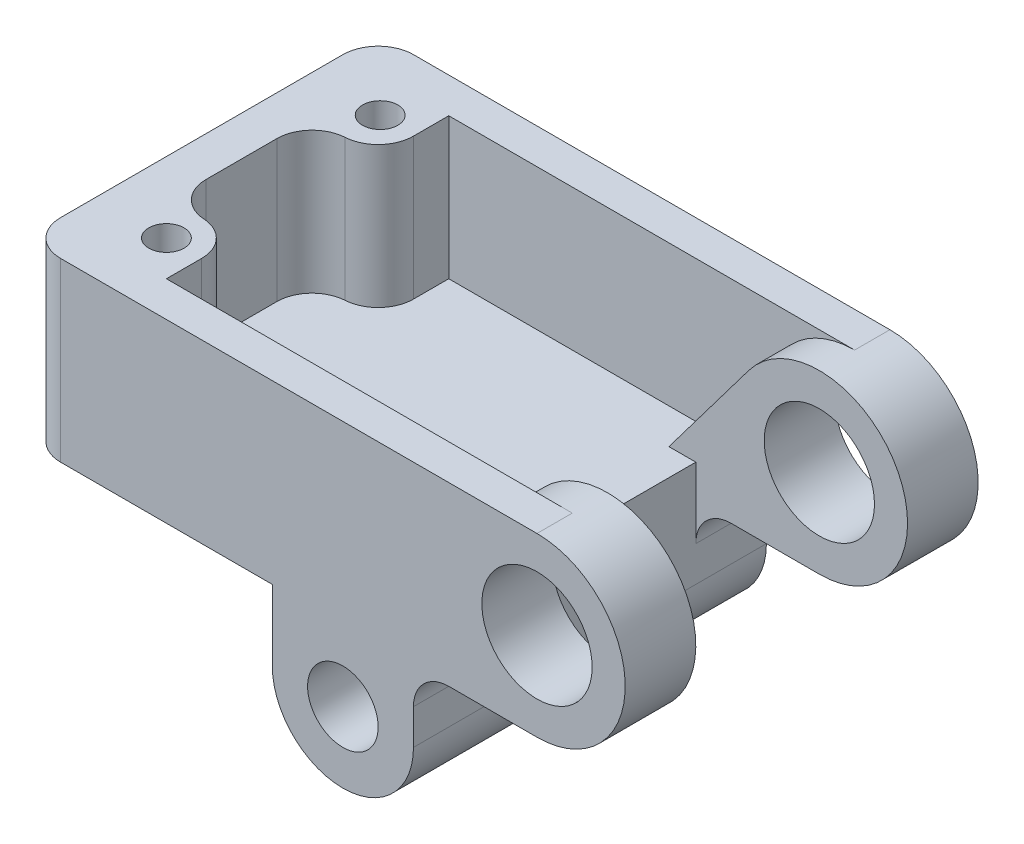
from build123d import *

# Parameters (mm, degrees)
SKETCH1_R                = 8
SKETCH1_R_2              = 12.5
BOSS_EXTRUDE1_DEPTH      = 40
CUT_EXTRUDE1_DEPTH       = 32
CUT_EXTRUDE2_REACH       = 149.296
SKETCH5_W                = 70.132841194
SKETCH5_H                = 64
BOSS_EXTRUDE2_START      = 8
SKETCH6_R                = 12.5
BOSS_EXTRUDE2_DEPTH      = 8
FILLET1_R                = 8
F_8_0_8_DIAMETER_HOLE1_D = 8
SKETCH11_R               = 4
BOSS_EXTRUDE3_DEPTH      = 8


with BuildPart() as part:
    # Sketch1 → Boss-Extrude1 (new, symmetric)
    with BuildSketch(Plane.XY):
        with BuildLine():
            Line((0, 40), (0, 0))
            Line((0, 0), (56, 0))
            Line((56, 0), (56, -16))
            ThreePointArc((56, -16), (72, -32), (88, -16))
            Line((88, -16), (88, 0))
            Line((88, 0), (116, 0))
            ThreePointArc((116, 0), (136, 20), (116, 40))
            Line((116, 40), (0, 40))
        make_face()
        with Locations((72, -16)):
            Circle(SKETCH1_R, mode=Mode.SUBTRACT)
        with Locations((116, 20)):
            Circle(SKETCH1_R_2, mode=Mode.SUBTRACT)
    extrude(amount=BOSS_EXTRUDE1_DEPTH, both=True)

    # Sketch2 → Cut-Extrude1 (cut)
    with BuildSketch(Plane(origin=(0, 40, 0), x_dir=(1, 0, 0), z_dir=(0, 1, 0))):
        with BuildLine():
            Line((9, 8.031280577), (9, -8.031280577))
            ThreePointArc((9, -8.031280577), (11.169048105, -13.508506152), (16.5, -16.015640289))
            ThreePointArc((16.5, -16.015640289), (21.830951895, -18.522774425), (24, -24))
            Line((24, -24), (24, -32))
            Line((24, -32), (150.373043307, -32))
            Line((150.373043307, -32), (150.373043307, 32))
            Line((150.373043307, 32), (24, 32))
            Line((24, 32), (24, 24))
            ThreePointArc((24, 24), (21.830951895, 18.522774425), (16.5, 16.015640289))
            ThreePointArc((16.5, 16.015640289), (11.169048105, 13.508506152), (9, 8.031280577))
        make_face()
    extrude(amount=-CUT_EXTRUDE1_DEPTH, mode=Mode.SUBTRACT)

    # Sketch5 → Cut-Extrude2 (cut, up to next)
    with BuildSketch(Plane(origin=(0, 8, 0), x_dir=(1, 0, 0), z_dir=(0, 1, 0)), mode=Mode.PRIVATE) as cut_extrude2_sk1:
        with Locations((123.066420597, 0)):
            Rectangle(SKETCH5_W, SKETCH5_H)
    cut_extrude2_tool1 = extrude(cut_extrude2_sk1.sketch, amount=-CUT_EXTRUDE2_REACH, mode=Mode.PRIVATE) & part.part
    add(cut_extrude2_tool1.solids().sort_by_distance((123.066421, 8, 0))[0], mode=Mode.SUBTRACT)

    # Sketch6 → Boss-Extrude2 (add)
    with BuildSketch(Plane.XY.offset(-32).offset(BOSS_EXTRUDE2_START)):
        with BuildLine():
            Line((88, 0), (116, 0))
            ThreePointArc((116, 0), (136, 20), (116, 40))
            ThreePointArc((116, 40), (107.076043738, 37.898687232), (100.027289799, 32.036300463))
            Line((100.027289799, 32.036300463), (81.914638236, 8))
            Line((81.914638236, 8), (88, 8))
            Line((88, 8), (88, 0))
        make_face()
        with Locations((116, 20)):
            Circle(SKETCH6_R, mode=Mode.SUBTRACT)
    boss_extrude2 = extrude(amount=-BOSS_EXTRUDE2_DEPTH)

    # Mirror1: Boss-Extrude2 across plane
    add(boss_extrude2.mirror(Plane.XY))

    # Fillet1
    fillet1_edges = [part.edges().sort_by_distance(p)[0] for p in [
        (0, 20, -40),
        (88, 0, 32),
        (0, 20, 40),
        (88, 0, -32),
    ]]
    fillet(fillet1_edges, radius=FILLET1_R)

    # 8.0 _8_ Diameter Hole1 (through all)
    with Locations(Plane(origin=(0, 40, 0), x_dir=(-1, 0, 0), z_dir=(0, 1, 0))):
        with Locations((-16.10585297, -24.349272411), (-16, 24)):
            Hole(F_8_0_8_DIAMETER_HOLE1_D / 2)

    # Sketch11 → Boss-Extrude3 (add)
    with BuildSketch(Plane.ZY):
        with BuildLine():
            Line((-16, 0), (16, 0))
            Line((16, 0), (16, 16))
            ThreePointArc((16, 16), (0, 32), (-16, 16))
            Line((-16, 16), (-16, 0))
        make_face()
        with Locations(Location((0, 16, 0), (0, 0, 270))):
            Circle(SKETCH11_R, mode=Mode.SUBTRACT)
    extrude(amount=BOSS_EXTRUDE3_DEPTH)


solid = part.part
